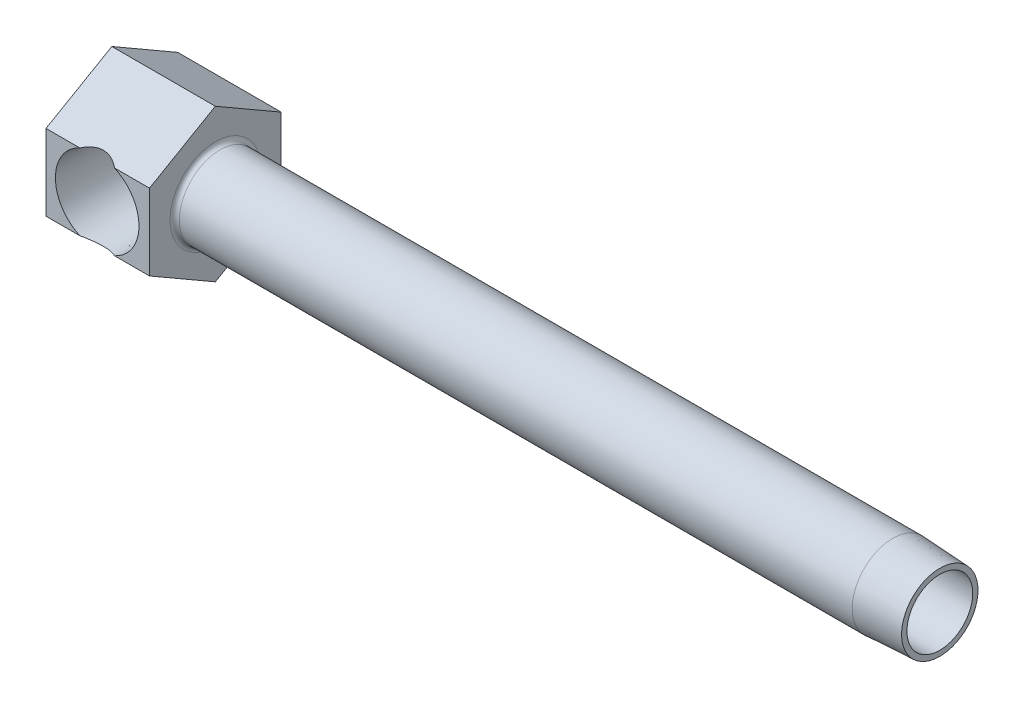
ISO-10303-21;
HEADER;
FILE_DESCRIPTION(('STEP AP214'),'2;1');
FILE_NAME('part.step','',(''),(''),'','','');
FILE_SCHEMA(('AUTOMOTIVE_DESIGN { 1 0 10303 214 1 1 1 1 }'));
ENDSEC;
DATA;
#1=APPLICATION_CONTEXT('core data for automotive mechanical design processes');
#2=APPLICATION_PROTOCOL_DEFINITION('international standard','automotive_design',2000,#1);
#3=PRODUCT_CONTEXT('',#1,'mechanical');
#4=PRODUCT('Part','Part','',(#3));
#5=PRODUCT_RELATED_PRODUCT_CATEGORY('part','',(#4));
#6=PRODUCT_DEFINITION_FORMATION('','',#4);
#7=PRODUCT_DEFINITION_CONTEXT('part definition',#1,'design');
#8=PRODUCT_DEFINITION('design','',#6,#7);
#9=PRODUCT_DEFINITION_SHAPE('','',#8);
#10=(LENGTH_UNIT() NAMED_UNIT(*) SI_UNIT(.MILLI.,.METRE.));
#11=(NAMED_UNIT(*) PLANE_ANGLE_UNIT() SI_UNIT($,.RADIAN.));
#12=(NAMED_UNIT(*) SI_UNIT($,.STERADIAN.) SOLID_ANGLE_UNIT());
#13=UNCERTAINTY_MEASURE_WITH_UNIT(LENGTH_MEASURE(1.E-05),#10,'distance_accuracy_value','');
#14=(GEOMETRIC_REPRESENTATION_CONTEXT(3) GLOBAL_UNCERTAINTY_ASSIGNED_CONTEXT((#13)) GLOBAL_UNIT_ASSIGNED_CONTEXT((#10,
#11,#12)) REPRESENTATION_CONTEXT('',''));
#15=CARTESIAN_POINT('',(0.,0.,0.));
#16=DIRECTION('',(0.,0.,1.));
#17=DIRECTION('',(1.,0.,0.));
#18=AXIS2_PLACEMENT_3D('',#15,#16,#17);
#19=CARTESIAN_POINT('',(63.5,0.,11.1125));
#20=DIRECTION('',(-1.,0.,0.));
#21=DIRECTION('',(0.,0.,1.));
#22=AXIS2_PLACEMENT_3D('',#19,#20,#21);
#23=CYLINDRICAL_SURFACE('',#22,6.858);
#24=CARTESIAN_POINT('',(18.2499,0.,11.1125));
#25=DIRECTION('',(-1.,0.,0.));
#26=DIRECTION('',(0.,-1.,0.));
#27=AXIS2_PLACEMENT_3D('',#24,#25,#26);
#28=CIRCLE('',#27,6.858);
#29=CARTESIAN_POINT('',(18.2499,-6.858,11.1125));
#30=VERTEX_POINT('',#29);
#31=EDGE_CURVE('E174',#30,#30,#28,.F.);
#32=ORIENTED_EDGE('',*,*,#31,.T.);
#33=EDGE_LOOP('',(#32));
#34=FACE_BOUND('',#33,.T.);
#35=CARTESIAN_POINT('',(131.7752,0.,11.1125));
#36=DIRECTION('',(1.,0.,0.));
#37=DIRECTION('',(0.,0.,-1.));
#38=AXIS2_PLACEMENT_3D('',#35,#36,#37);
#39=CIRCLE('',#38,6.858);
#40=CARTESIAN_POINT('',(131.7752,0.,4.2545));
#41=VERTEX_POINT('',#40);
#42=EDGE_CURVE('E218',#41,#41,#39,.T.);
#43=ORIENTED_EDGE('',*,*,#42,.F.);
#44=EDGE_LOOP('',(#43));
#45=FACE_BOUND('',#44,.T.);
#46=ADVANCED_FACE('F15',(#34,#45),#23,.T.);
#47=CARTESIAN_POINT('',(17.4625,6.4158048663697,22.225));
#48=DIRECTION('',(0.,0.,-1.));
#49=DIRECTION('',(0.,1.,0.));
#50=AXIS2_PLACEMENT_3D('',#47,#48,#49);
#51=PLANE('',#50);
#52=CARTESIAN_POINT('',(8.636,0.,22.225));
#53=DIRECTION('',(0.,0.,1.));
#54=DIRECTION('',(1.,0.,0.));
#55=AXIS2_PLACEMENT_3D('',#52,#53,#54);
#56=CIRCLE('',#55,7.05231);
#57=CARTESIAN_POINT('',(5.70811266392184,6.4158048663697,22.225));
#58=VERTEX_POINT('',#57);
#59=CARTESIAN_POINT('',(5.70811266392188,-6.41580486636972,22.225));
#60=VERTEX_POINT('',#59);
#61=EDGE_CURVE('E229',#58,#60,#56,.T.);
#62=ORIENTED_EDGE('',*,*,#61,.F.);
#63=DIRECTION('',(-1.,0.,0.));
#64=VECTOR('',#63,1.);
#65=CARTESIAN_POINT('',(17.4625,6.4158048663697,22.225));
#66=LINE('',#65,#64);
#67=CARTESIAN_POINT('',(0.,6.4158048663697,22.225));
#68=VERTEX_POINT('',#67);
#69=EDGE_CURVE('E158',#58,#68,#66,.T.);
#70=ORIENTED_EDGE('',*,*,#69,.T.);
#71=DIRECTION('',(0.,-1.,0.));
#72=VECTOR('',#71,1.);
#73=CARTESIAN_POINT('',(0.,6.4158048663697,22.225));
#74=LINE('',#73,#72);
#75=CARTESIAN_POINT('',(0.,-6.41580486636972,22.225));
#76=VERTEX_POINT('',#75);
#77=EDGE_CURVE('E128',#68,#76,#74,.T.);
#78=ORIENTED_EDGE('',*,*,#77,.T.);
#79=DIRECTION('',(-1.,0.,0.));
#80=VECTOR('',#79,1.);
#81=CARTESIAN_POINT('',(17.4625,-6.41580486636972,22.225));
#82=LINE('',#81,#80);
#83=EDGE_CURVE('E154',#60,#76,#82,.T.);
#84=ORIENTED_EDGE('',*,*,#83,.F.);
#85=EDGE_LOOP('',(#62,#70,#78,#84));
#86=FACE_BOUND('',#85,.T.);
#87=ADVANCED_FACE('F205',(#86),#51,.F.);
#88=CARTESIAN_POINT('',(11.5638873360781,-6.41580486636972,22.225));
#89=VERTEX_POINT('',#88);
#90=CARTESIAN_POINT('',(11.5638873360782,6.4158048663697,22.225));
#91=VERTEX_POINT('',#90);
#92=EDGE_CURVE('E228',#89,#91,#56,.T.);
#93=ORIENTED_EDGE('',*,*,#92,.F.);
#94=CARTESIAN_POINT('',(17.4625,-6.41580486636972,22.225));
#95=VERTEX_POINT('',#94);
#96=EDGE_CURVE('E155',#95,#89,#82,.T.);
#97=ORIENTED_EDGE('',*,*,#96,.F.);
#98=DIRECTION('',(0.,-1.,0.));
#99=VECTOR('',#98,1.);
#100=CARTESIAN_POINT('',(17.4625,6.4158048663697,22.225));
#101=LINE('',#100,#99);
#102=CARTESIAN_POINT('',(17.4625,6.4158048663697,22.225));
#103=VERTEX_POINT('',#102);
#104=EDGE_CURVE('E145',#103,#95,#101,.T.);
#105=ORIENTED_EDGE('',*,*,#104,.F.);
#106=EDGE_CURVE('E159',#103,#91,#66,.T.);
#107=ORIENTED_EDGE('',*,*,#106,.T.);
#108=EDGE_LOOP('',(#93,#97,#105,#107));
#109=FACE_BOUND('',#108,.T.);
#110=ADVANCED_FACE('F211',(#109),#51,.F.);
#111=CARTESIAN_POINT('',(17.4625,12.8316097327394,11.1125));
#112=DIRECTION('',(0.,-0.866025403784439,-0.5));
#113=DIRECTION('',(0.,0.5,-0.866025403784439));
#114=AXIS2_PLACEMENT_3D('',#111,#112,#113);
#115=PLANE('',#114);
#116=ORIENTED_EDGE('',*,*,#69,.F.);
#117=CARTESIAN_POINT('',(8.636,-0.384020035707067,34.002642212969));
#118=DIRECTION('',(0.,-0.866025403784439,-0.5));
#119=DIRECTION('',(0.,-0.5,0.866025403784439));
#120=AXIS2_PLACEMENT_3D('',#117,#118,#119);
#121=ELLIPSE('',#120,14.8098967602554,7.39498405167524);
#122=EDGE_CURVE('E109',#58,#91,#121,.T.);
#123=ORIENTED_EDGE('',*,*,#122,.T.);
#124=ORIENTED_EDGE('',*,*,#106,.F.);
#125=DIRECTION('',(0.,-0.5,0.866025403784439));
#126=VECTOR('',#125,1.);
#127=CARTESIAN_POINT('',(17.4625,12.8316097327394,11.1125));
#128=LINE('',#127,#126);
#129=CARTESIAN_POINT('',(17.4625,12.8316097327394,11.1125));
#130=VERTEX_POINT('',#129);
#131=EDGE_CURVE('E143',#130,#103,#128,.T.);
#132=ORIENTED_EDGE('',*,*,#131,.F.);
#133=DIRECTION('',(-1.,0.,0.));
#134=VECTOR('',#133,1.);
#135=CARTESIAN_POINT('',(17.4625,12.8316097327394,11.1125));
#136=LINE('',#135,#134);
#137=CARTESIAN_POINT('',(0.,12.8316097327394,11.1125));
#138=VERTEX_POINT('',#137);
#139=EDGE_CURVE('E162',#130,#138,#136,.T.);
#140=ORIENTED_EDGE('',*,*,#139,.T.);
#141=DIRECTION('',(0.,-0.5,0.866025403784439));
#142=VECTOR('',#141,1.);
#143=CARTESIAN_POINT('',(0.,12.8316097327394,11.1125));
#144=LINE('',#143,#142);
#145=EDGE_CURVE('E124',#138,#68,#144,.T.);
#146=ORIENTED_EDGE('',*,*,#145,.T.);
#147=EDGE_LOOP('',(#116,#123,#124,#132,#140,#146));
#148=FACE_BOUND('',#147,.T.);
#149=ADVANCED_FACE('F257',(#148),#115,.F.);
#150=CARTESIAN_POINT('',(17.4625,-6.41580486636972,22.225));
#151=DIRECTION('',(0.,0.866025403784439,-0.5));
#152=DIRECTION('',(0.,0.5,0.866025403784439));
#153=AXIS2_PLACEMENT_3D('',#150,#151,#152);
#154=PLANE('',#153);
#155=ORIENTED_EDGE('',*,*,#96,.T.);
#156=CARTESIAN_POINT('',(8.636,0.384020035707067,34.0026422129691));
#157=DIRECTION('',(0.,0.866025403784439,-0.5));
#158=DIRECTION('',(0.,0.5,0.866025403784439));
#159=AXIS2_PLACEMENT_3D('',#156,#157,#158);
#160=ELLIPSE('',#159,14.8098967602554,7.39498405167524);
#161=EDGE_CURVE('E34',#89,#60,#160,.T.);
#162=ORIENTED_EDGE('',*,*,#161,.T.);
#163=ORIENTED_EDGE('',*,*,#83,.T.);
#164=DIRECTION('',(0.,-0.5,-0.866025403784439));
#165=VECTOR('',#164,1.);
#166=CARTESIAN_POINT('',(0.,-6.41580486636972,22.225));
#167=LINE('',#166,#165);
#168=CARTESIAN_POINT('',(0.,-12.8316097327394,11.1125));
#169=VERTEX_POINT('',#168);
#170=EDGE_CURVE('E132',#76,#169,#167,.T.);
#171=ORIENTED_EDGE('',*,*,#170,.T.);
#172=DIRECTION('',(-1.,0.,0.));
#173=VECTOR('',#172,1.);
#174=CARTESIAN_POINT('',(17.4625,-12.8316097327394,11.1125));
#175=LINE('',#174,#173);
#176=CARTESIAN_POINT('',(17.4625,-12.8316097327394,11.1125));
#177=VERTEX_POINT('',#176);
#178=EDGE_CURVE('E149',#177,#169,#175,.T.);
#179=ORIENTED_EDGE('',*,*,#178,.F.);
#180=DIRECTION('',(0.,-0.5,-0.866025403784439));
#181=VECTOR('',#180,1.);
#182=CARTESIAN_POINT('',(17.4625,-6.41580486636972,22.225));
#183=LINE('',#182,#181);
#184=EDGE_CURVE('E147',#95,#177,#183,.T.);
#185=ORIENTED_EDGE('',*,*,#184,.F.);
#186=EDGE_LOOP('',(#155,#162,#163,#171,#179,#185));
#187=FACE_BOUND('',#186,.T.);
#188=ADVANCED_FACE('F235',(#187),#154,.F.);
#189=CARTESIAN_POINT('',(17.4625,-12.8316097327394,11.1125));
#190=DIRECTION('',(0.,0.866025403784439,0.5));
#191=DIRECTION('',(0.,-0.5,0.866025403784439));
#192=AXIS2_PLACEMENT_3D('',#189,#190,#191);
#193=PLANE('',#192);
#194=DIRECTION('',(0.,0.5,-0.866025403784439));
#195=VECTOR('',#194,1.);
#196=CARTESIAN_POINT('',(0.,-12.8316097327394,11.1125));
#197=LINE('',#196,#195);
#198=CARTESIAN_POINT('',(0.,-6.41580486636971,0.));
#199=VERTEX_POINT('',#198);
#200=EDGE_CURVE('E117',#169,#199,#197,.T.);
#201=ORIENTED_EDGE('',*,*,#200,.T.);
#202=DIRECTION('',(-1.,0.,0.));
#203=VECTOR('',#202,1.);
#204=CARTESIAN_POINT('',(17.4625,-6.41580486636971,0.));
#205=LINE('',#204,#203);
#206=CARTESIAN_POINT('',(17.4625,-6.41580486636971,0.));
#207=VERTEX_POINT('',#206);
#208=EDGE_CURVE('E168',#207,#199,#205,.T.);
#209=ORIENTED_EDGE('',*,*,#208,.F.);
#210=DIRECTION('',(0.,0.5,-0.866025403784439));
#211=VECTOR('',#210,1.);
#212=CARTESIAN_POINT('',(17.4625,-12.8316097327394,11.1125));
#213=LINE('',#212,#211);
#214=EDGE_CURVE('E135',#177,#207,#213,.T.);
#215=ORIENTED_EDGE('',*,*,#214,.F.);
#216=ORIENTED_EDGE('',*,*,#178,.T.);
#217=EDGE_LOOP('',(#201,#209,#215,#216));
#218=FACE_BOUND('',#217,.T.);
#219=ADVANCED_FACE('F247',(#218),#193,.F.);
#220=CARTESIAN_POINT('',(17.4625,-6.41580486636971,0.));
#221=DIRECTION('',(0.,0.,1.));
#222=DIRECTION('',(1.,0.,0.));
#223=AXIS2_PLACEMENT_3D('',#220,#221,#222);
#224=PLANE('',#223);
#225=DIRECTION('',(0.,1.,0.));
#226=VECTOR('',#225,1.);
#227=CARTESIAN_POINT('',(0.,-6.41580486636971,0.));
#228=LINE('',#227,#226);
#229=CARTESIAN_POINT('',(0.,6.41580486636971,0.));
#230=VERTEX_POINT('',#229);
#231=EDGE_CURVE('E118',#199,#230,#228,.T.);
#232=ORIENTED_EDGE('',*,*,#231,.T.);
#233=DIRECTION('',(-1.,0.,0.));
#234=VECTOR('',#233,1.);
#235=CARTESIAN_POINT('',(17.4625,6.41580486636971,0.));
#236=LINE('',#235,#234);
#237=CARTESIAN_POINT('',(17.4625,6.41580486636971,0.));
#238=VERTEX_POINT('',#237);
#239=EDGE_CURVE('E165',#238,#230,#236,.T.);
#240=ORIENTED_EDGE('',*,*,#239,.F.);
#241=DIRECTION('',(0.,1.,0.));
#242=VECTOR('',#241,1.);
#243=CARTESIAN_POINT('',(17.4625,-6.41580486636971,0.));
#244=LINE('',#243,#242);
#245=EDGE_CURVE('E139',#207,#238,#244,.T.);
#246=ORIENTED_EDGE('',*,*,#245,.F.);
#247=ORIENTED_EDGE('',*,*,#208,.T.);
#248=EDGE_LOOP('',(#232,#240,#246,#247));
#249=FACE_BOUND('',#248,.T.);
#250=ADVANCED_FACE('F264',(#249),#224,.F.);
#251=CARTESIAN_POINT('',(17.4625,6.4158048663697,0.));
#252=DIRECTION('',(0.,-0.866025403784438,0.5));
#253=DIRECTION('',(0.,-0.5,-0.866025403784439));
#254=AXIS2_PLACEMENT_3D('',#251,#252,#253);
#255=PLANE('',#254);
#256=DIRECTION('',(0.,0.5,0.866025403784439));
#257=VECTOR('',#256,1.);
#258=CARTESIAN_POINT('',(0.,6.4158048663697,0.));
#259=LINE('',#258,#257);
#260=EDGE_CURVE('E121',#230,#138,#259,.T.);
#261=ORIENTED_EDGE('',*,*,#260,.T.);
#262=ORIENTED_EDGE('',*,*,#139,.F.);
#263=DIRECTION('',(0.,0.5,0.866025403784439));
#264=VECTOR('',#263,1.);
#265=CARTESIAN_POINT('',(17.4625,6.4158048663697,0.));
#266=LINE('',#265,#264);
#267=EDGE_CURVE('E141',#238,#130,#266,.T.);
#268=ORIENTED_EDGE('',*,*,#267,.F.);
#269=ORIENTED_EDGE('',*,*,#239,.T.);
#270=EDGE_LOOP('',(#261,#262,#268,#269));
#271=FACE_BOUND('',#270,.T.);
#272=ADVANCED_FACE('F261',(#271),#255,.F.);
#273=CARTESIAN_POINT('',(17.4625,-19.2474145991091,22.225));
#274=DIRECTION('',(-1.,0.,0.));
#275=DIRECTION('',(0.,-1.,0.));
#276=AXIS2_PLACEMENT_3D('',#273,#274,#275);
#277=PLANE('',#276);
#278=CARTESIAN_POINT('',(17.4625,0.,11.1125));
#279=DIRECTION('',(-1.,0.,0.));
#280=DIRECTION('',(0.,-1.,0.));
#281=AXIS2_PLACEMENT_3D('',#278,#279,#280);
#282=CIRCLE('',#281,7.6454);
#283=CARTESIAN_POINT('',(17.4625,-7.6454,11.1125));
#284=VERTEX_POINT('',#283);
#285=EDGE_CURVE('E171',#284,#284,#282,.T.);
#286=ORIENTED_EDGE('',*,*,#285,.T.);
#287=EDGE_LOOP('',(#286));
#288=FACE_BOUND('',#287,.T.);
#289=ORIENTED_EDGE('',*,*,#214,.T.);
#290=ORIENTED_EDGE('',*,*,#245,.T.);
#291=ORIENTED_EDGE('',*,*,#267,.T.);
#292=ORIENTED_EDGE('',*,*,#131,.T.);
#293=ORIENTED_EDGE('',*,*,#104,.T.);
#294=ORIENTED_EDGE('',*,*,#184,.T.);
#295=EDGE_LOOP('',(#289,#290,#291,#292,#293,#294));
#296=FACE_BOUND('',#295,.T.);
#297=ADVANCED_FACE('F250',(#288,#296),#277,.F.);
#298=CARTESIAN_POINT('',(0.,-19.2474145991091,22.225));
#299=DIRECTION('',(-1.,0.,0.));
#300=DIRECTION('',(0.,-1.,0.));
#301=AXIS2_PLACEMENT_3D('',#298,#299,#300);
#302=PLANE('',#301);
#303=ORIENTED_EDGE('',*,*,#200,.F.);
#304=ORIENTED_EDGE('',*,*,#170,.F.);
#305=ORIENTED_EDGE('',*,*,#77,.F.);
#306=ORIENTED_EDGE('',*,*,#145,.F.);
#307=ORIENTED_EDGE('',*,*,#260,.F.);
#308=ORIENTED_EDGE('',*,*,#231,.F.);
#309=EDGE_LOOP('',(#303,#304,#305,#306,#307,#308));
#310=FACE_BOUND('',#309,.T.);
#311=ADVANCED_FACE('F243',(#310),#302,.T.);
#312=CARTESIAN_POINT('',(18.2499,0.,11.1125));
#313=DIRECTION('',(-1.,0.,0.));
#314=DIRECTION('',(0.,-1.,0.));
#315=AXIS2_PLACEMENT_3D('',#312,#313,#314);
#316=TOROIDAL_SURFACE('',#315,7.6454,0.7874);
#317=ORIENTED_EDGE('',*,*,#31,.F.);
#318=EDGE_LOOP('',(#317));
#319=FACE_BOUND('',#318,.T.);
#320=ORIENTED_EDGE('',*,*,#285,.F.);
#321=EDGE_LOOP('',(#320));
#322=FACE_BOUND('',#321,.T.);
#323=ADVANCED_FACE('F282',(#319,#322),#316,.F.);
#324=CARTESIAN_POINT('',(63.5,0.,11.1125));
#325=DIRECTION('',(1.,0.,0.));
#326=DIRECTION('',(0.,0.,-1.));
#327=AXIS2_PLACEMENT_3D('',#324,#325,#326);
#328=CYLINDRICAL_SURFACE('',#327,5.5499);
#329=DIRECTION('',(1.,0.,0.));
#330=VECTOR('',#329,1.);
#331=CARTESIAN_POINT('',(63.5,1.29165930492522,5.715));
#332=LINE('',#331,#330);
#333=CARTESIAN_POINT('',(15.0655177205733,1.29165930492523,5.715));
#334=VERTEX_POINT('',#333);
#335=CARTESIAN_POINT('',(14.0465577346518,1.29165930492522,5.715));
#336=VERTEX_POINT('',#335);
#337=EDGE_CURVE('E27',#334,#336,#332,.F.);
#338=ORIENTED_EDGE('',*,*,#337,.T.);
#339=CARTESIAN_POINT('',(14.0465577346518,1.29165930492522,5.715));
#340=CARTESIAN_POINT('',(14.0725617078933,1.1828202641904,5.68893317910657));
#341=CARTESIAN_POINT('',(14.0954190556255,1.0724477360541,5.66602138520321));
#342=CARTESIAN_POINT('',(14.1345363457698,0.849345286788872,5.62681178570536));
#343=CARTESIAN_POINT('',(14.1507939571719,0.736614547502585,5.61051631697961));
#344=CARTESIAN_POINT('',(14.1760383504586,0.512691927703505,5.58521342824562));
#345=CARTESIAN_POINT('',(14.1852120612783,0.401542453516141,5.57601863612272));
#346=CARTESIAN_POINT('',(14.1968530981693,0.17856718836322,5.56435088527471));
#347=CARTESIAN_POINT('',(14.1993222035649,0.0667415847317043,5.56187614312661));
#348=CARTESIAN_POINT('',(14.1975723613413,-0.14949882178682,5.56362999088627));
#349=CARTESIAN_POINT('',(14.193779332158,-0.253921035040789,5.56743168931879));
#350=CARTESIAN_POINT('',(14.1803598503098,-0.462026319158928,5.58088200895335));
#351=CARTESIAN_POINT('',(14.1707325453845,-0.565709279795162,5.59053148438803));
#352=CARTESIAN_POINT('',(14.1454600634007,-0.774399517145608,5.61586264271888));
#353=CARTESIAN_POINT('',(14.12966315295,-0.87936981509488,5.63169642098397));
#354=CARTESIAN_POINT('',(14.092340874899,-1.08722287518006,5.6691068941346));
#355=CARTESIAN_POINT('',(14.0708169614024,-1.1901061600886,5.69068213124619));
#356=CARTESIAN_POINT('',(14.0465577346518,-1.29165930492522,5.715));
#357=B_SPLINE_CURVE_WITH_KNOTS('',3,(#339,#340,#341,#342,#343,#344,#345,#346,#347,#348,#349,
#350,#351,#352,#353,#354,#355,#356),.UNSPECIFIED.,.F.,.F.,(4,2,2,2,2,2,2,2,4),(0.,
0.344637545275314,0.689396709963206,1.02471413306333,1.35994255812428,1.67329546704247,
1.98669416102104,2.30834220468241,2.62990865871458),.UNSPECIFIED.);
#358=CARTESIAN_POINT('',(14.0465577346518,-1.29165930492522,5.715));
#359=VERTEX_POINT('',#358);
#360=EDGE_CURVE('E10',#336,#359,#357,.T.);
#361=ORIENTED_EDGE('',*,*,#360,.T.);
#362=DIRECTION('',(1.,0.,0.));
#363=VECTOR('',#362,1.);
#364=CARTESIAN_POINT('',(63.5,-1.29165930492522,5.715));
#365=LINE('',#364,#363);
#366=CARTESIAN_POINT('',(15.0655177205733,-1.29165930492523,5.715));
#367=VERTEX_POINT('',#366);
#368=EDGE_CURVE('E184',#359,#367,#365,.T.);
#369=ORIENTED_EDGE('',*,*,#368,.T.);
#370=CARTESIAN_POINT('',(15.0656795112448,-1.29082327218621,5.71480000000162));
#371=CARTESIAN_POINT('',(15.0372536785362,-1.43791824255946,5.7499521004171));
#372=CARTESIAN_POINT('',(15.0041876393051,-1.58262926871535,5.79093746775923));
#373=CARTESIAN_POINT('',(14.9298152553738,-1.86616189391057,5.88364074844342));
#374=CARTESIAN_POINT('',(14.8885204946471,-2.00499144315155,5.93534357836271));
#375=CARTESIAN_POINT('',(14.7990709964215,-2.27477346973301,6.0481148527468));
#376=CARTESIAN_POINT('',(14.7509848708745,-2.40578805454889,6.10909004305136));
#377=CARTESIAN_POINT('',(14.6486806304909,-2.66083130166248,6.2399326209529));
#378=CARTESIAN_POINT('',(14.5944604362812,-2.78485757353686,6.30980302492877));
#379=CARTESIAN_POINT('',(14.4812536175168,-3.02482355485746,6.4572285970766));
#380=CARTESIAN_POINT('',(14.4222960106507,-3.1408054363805,6.53473755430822));
#381=CARTESIAN_POINT('',(14.3003856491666,-3.365215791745,6.6970845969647));
#382=CARTESIAN_POINT('',(14.2374332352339,-3.47364490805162,6.78192205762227));
#383=CARTESIAN_POINT('',(14.0435453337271,-3.78827180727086,7.04729631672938));
#384=CARTESIAN_POINT('',(13.9079456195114,-3.9830565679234,7.23822682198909));
#385=CARTESIAN_POINT('',(13.689310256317,-4.26816238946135,7.56146618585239));
#386=CARTESIAN_POINT('',(13.6074310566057,-4.3686517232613,7.68585924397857));
#387=CARTESIAN_POINT('',(13.4442899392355,-4.55879004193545,7.94320688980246));
#388=CARTESIAN_POINT('',(13.3630282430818,-4.6484352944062,8.07616440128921));
#389=CARTESIAN_POINT('',(13.2036424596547,-4.81645966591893,8.35044586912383));
#390=CARTESIAN_POINT('',(13.1255135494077,-4.89485662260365,8.49175606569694));
#391=CARTESIAN_POINT('',(12.9752684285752,-5.04004510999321,8.78316437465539));
#392=CARTESIAN_POINT('',(12.9031480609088,-5.10684469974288,8.93325628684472));
#393=CARTESIAN_POINT('',(12.757824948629,-5.23785122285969,9.26762207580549));
#394=CARTESIAN_POINT('',(12.686320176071,-5.29990617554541,9.45350692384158));
#395=CARTESIAN_POINT('',(12.5645322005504,-5.40502712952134,9.83721903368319));
#396=CARTESIAN_POINT('',(12.5142004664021,-5.44813656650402,10.035017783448));
#397=CARTESIAN_POINT('',(12.4606756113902,-5.49679755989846,10.3395644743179));
#398=CARTESIAN_POINT('',(12.4464754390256,-5.51038902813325,10.443158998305));
#399=CARTESIAN_POINT('',(12.4264834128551,-5.5317354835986,10.6517762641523));
#400=CARTESIAN_POINT('',(12.4206908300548,-5.53949097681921,10.7567988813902));
#401=CARTESIAN_POINT('',(12.4179376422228,-5.54899639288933,10.9671942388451));
#402=CARTESIAN_POINT('',(12.4209736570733,-5.55074861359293,11.0725668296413));
#403=CARTESIAN_POINT('',(12.4357182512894,-5.54828805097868,11.2826067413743));
#404=CARTESIAN_POINT('',(12.4474268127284,-5.54407527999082,11.3872740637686));
#405=CARTESIAN_POINT('',(12.4900727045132,-5.52483789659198,11.6684350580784));
#406=CARTESIAN_POINT('',(12.5287513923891,-5.5042766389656,11.8434168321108));
#407=CARTESIAN_POINT('',(12.6245766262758,-5.44793106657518,12.1856637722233));
#408=CARTESIAN_POINT('',(12.6817493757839,-5.41212512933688,12.3529176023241));
#409=CARTESIAN_POINT('',(12.8020710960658,-5.33165221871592,12.6608364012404));
#410=CARTESIAN_POINT('',(12.8638814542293,-5.28838367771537,12.8024081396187));
#411=CARTESIAN_POINT('',(12.9946271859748,-5.19196308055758,13.0788046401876));
#412=CARTESIAN_POINT('',(13.0635675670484,-5.13880405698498,13.2136245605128));
#413=CARTESIAN_POINT('',(13.2061680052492,-5.0230773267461,13.476991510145));
#414=CARTESIAN_POINT('',(13.2798387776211,-4.96048779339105,13.6055230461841));
#415=CARTESIAN_POINT('',(13.4297455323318,-4.82635797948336,13.8561944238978));
#416=CARTESIAN_POINT('',(13.505980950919,-4.75481965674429,13.9783356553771));
#417=CARTESIAN_POINT('',(13.664111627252,-4.59832635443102,14.2236446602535));
#418=CARTESIAN_POINT('',(13.7460684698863,-4.51281916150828,14.3464205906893));
#419=CARTESIAN_POINT('',(13.9094765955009,-4.33199713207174,14.5849036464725));
#420=CARTESIAN_POINT('',(13.9909278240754,-4.23668125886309,14.7006100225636));
#421=CARTESIAN_POINT('',(14.1517819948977,-4.03638256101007,14.9245234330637));
#422=CARTESIAN_POINT('',(14.231187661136,-3.93141354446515,15.0327408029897));
#423=CARTESIAN_POINT('',(14.3867175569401,-3.71172769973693,15.2413555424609));
#424=CARTESIAN_POINT('',(14.4628409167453,-3.59700831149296,15.3417508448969));
#425=CARTESIAN_POINT('',(14.668135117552,-3.26437402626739,15.6091426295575));
#426=CARTESIAN_POINT('',(14.7924014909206,-3.03572507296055,15.7670513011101));
#427=CARTESIAN_POINT('',(14.961823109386,-2.67104021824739,15.9794040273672));
#428=CARTESIAN_POINT('',(15.0154673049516,-2.54586009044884,16.0461031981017));
#429=CARTESIAN_POINT('',(15.1161712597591,-2.28856209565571,16.1705894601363));
#430=CARTESIAN_POINT('',(15.1632322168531,-2.15644549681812,16.2283781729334));
#431=CARTESIAN_POINT('',(15.2428146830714,-1.9076542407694,16.3256678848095));
#432=CARTESIAN_POINT('',(15.2764575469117,-1.79190088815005,16.3666154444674));
#433=CARTESIAN_POINT('',(15.3378292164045,-1.55651069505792,16.4410921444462));
#434=CARTESIAN_POINT('',(15.3655591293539,-1.43687458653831,16.4746226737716));
#435=CARTESIAN_POINT('',(15.4145953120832,-1.19439983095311,16.5337884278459));
#436=CARTESIAN_POINT('',(15.4359031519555,-1.0715619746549,16.5594255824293));
#437=CARTESIAN_POINT('',(15.4716760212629,-0.823504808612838,16.6024058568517));
#438=CARTESIAN_POINT('',(15.4861437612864,-0.698286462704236,16.6197522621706));
#439=CARTESIAN_POINT('',(15.5079865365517,-0.445852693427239,16.645922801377));
#440=CARTESIAN_POINT('',(15.5153340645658,-0.318631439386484,16.6547138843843));
#441=CARTESIAN_POINT('',(15.522677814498,-0.063671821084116,16.6635004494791));
#442=CARTESIAN_POINT('',(15.5226740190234,0.0640665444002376,16.6634959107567));
#443=CARTESIAN_POINT('',(15.5153149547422,0.319031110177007,16.6546910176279));
#444=CARTESIAN_POINT('',(15.5079593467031,0.446257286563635,16.64589025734));
#445=CARTESIAN_POINT('',(15.4860583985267,0.699182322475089,16.6196499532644));
#446=CARTESIAN_POINT('',(15.4715132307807,0.824881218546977,16.6022106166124));
#447=CARTESIAN_POINT('',(15.4365532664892,1.06681669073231,16.5602063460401));
#448=CARTESIAN_POINT('',(15.4165150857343,1.18318753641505,16.5360979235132));
#449=CARTESIAN_POINT('',(15.370668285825,1.41308832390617,16.4807930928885));
#450=CARTESIAN_POINT('',(15.3448577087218,1.52661728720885,16.4495942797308));
#451=CARTESIAN_POINT('',(15.2593968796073,1.8619852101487,16.3459550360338));
#452=CARTESIAN_POINT('',(15.1916934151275,2.07876635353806,16.2634431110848));
#453=CARTESIAN_POINT('',(15.0313088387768,2.51543897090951,16.0659794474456));
#454=CARTESIAN_POINT('',(14.9368359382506,2.73357267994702,15.9486491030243));
#455=CARTESIAN_POINT('',(14.7321201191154,3.14711164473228,15.6903358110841));
#456=CARTESIAN_POINT('',(14.6218705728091,3.34250728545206,15.549342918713));
#457=CARTESIAN_POINT('',(14.3660176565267,3.74896640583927,15.2149275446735));
#458=CARTESIAN_POINT('',(14.217881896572,3.95452519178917,15.0167316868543));
#459=CARTESIAN_POINT('',(13.9905991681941,4.23685264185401,14.7000501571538));
#460=CARTESIAN_POINT('',(13.9138995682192,4.32671599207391,14.5911203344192));
#461=CARTESIAN_POINT('',(13.7600052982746,4.49774000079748,14.366972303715));
#462=CARTESIAN_POINT('',(13.682810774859,4.57890311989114,14.2517558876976));
#463=CARTESIAN_POINT('',(13.5283146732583,4.73340315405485,14.0136509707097));
#464=CARTESIAN_POINT('',(13.4510233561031,4.80663208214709,13.8906858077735));
#465=CARTESIAN_POINT('',(13.2989020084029,4.94395744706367,13.6382338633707));
#466=CARTESIAN_POINT('',(13.2240725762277,5.00805167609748,13.5087455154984));
#467=CARTESIAN_POINT('',(13.0790371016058,5.12664196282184,13.2432341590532));
#468=CARTESIAN_POINT('',(13.0088235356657,5.18115389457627,13.107222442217));
#469=CARTESIAN_POINT('',(12.8755190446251,5.28008101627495,12.8283198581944));
#470=CARTESIAN_POINT('',(12.8124234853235,5.3245027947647,12.6854335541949));
#471=CARTESIAN_POINT('',(12.6833891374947,5.4112685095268,12.3591277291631));
#472=CARTESIAN_POINT('',(12.6200540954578,5.45085356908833,12.1738679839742));
#473=CARTESIAN_POINT('',(12.5423523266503,5.49611259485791,11.8892630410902));
#474=CARTESIAN_POINT('',(12.5193453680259,5.50884182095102,11.7933456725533));
#475=CARTESIAN_POINT('',(12.4799604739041,5.52933440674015,11.5996550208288));
#476=CARTESIAN_POINT('',(12.4635791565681,5.53710030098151,11.5018827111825));
#477=CARTESIAN_POINT('',(12.4380468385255,5.54748556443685,11.3040796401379));
#478=CARTESIAN_POINT('',(12.4289726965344,5.55005064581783,11.2040359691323));
#479=CARTESIAN_POINT('',(12.418786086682,5.54973569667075,11.0035516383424));
#480=CARTESIAN_POINT('',(12.4176731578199,5.54685598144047,10.9031110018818));
#481=CARTESIAN_POINT('',(12.4234254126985,5.53566138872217,10.7027211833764));
#482=CARTESIAN_POINT('',(12.4302942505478,5.52734402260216,10.6027722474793));
#483=CARTESIAN_POINT('',(12.4515981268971,5.5054275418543,10.4042328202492));
#484=CARTESIAN_POINT('',(12.4660373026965,5.4918255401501,10.3056431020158));
#485=CARTESIAN_POINT('',(12.5044721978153,5.45712893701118,10.0955734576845));
#486=CARTESIAN_POINT('',(12.5295946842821,5.43520467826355,9.98443807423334));
#487=CARTESIAN_POINT('',(12.5874763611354,5.38514310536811,9.76556012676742));
#488=CARTESIAN_POINT('',(12.6202414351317,5.35700100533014,9.65782024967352));
#489=CARTESIAN_POINT('',(12.6919869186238,5.29489520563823,9.44585515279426));
#490=CARTESIAN_POINT('',(12.7309829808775,5.2609168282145,9.34163960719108));
#491=CARTESIAN_POINT('',(12.813732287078,5.18758941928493,9.13712531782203));
#492=CARTESIAN_POINT('',(12.8574843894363,5.14824167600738,9.03682564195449));
#493=CARTESIAN_POINT('',(12.9739768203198,5.04107082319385,8.78510193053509));
#494=CARTESIAN_POINT('',(13.0492646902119,4.96961386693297,8.63639571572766));
#495=CARTESIAN_POINT('',(13.2048344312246,4.81508369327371,8.34787401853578));
#496=CARTESIAN_POINT('',(13.2851189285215,4.73200433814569,8.20806329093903));
#497=CARTESIAN_POINT('',(13.4480056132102,4.55446924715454,7.93688996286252));
#498=CARTESIAN_POINT('',(13.5306114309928,4.45999483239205,7.80554179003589));
#499=CARTESIAN_POINT('',(13.6957298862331,4.25996324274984,7.55156980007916));
#500=CARTESIAN_POINT('',(13.7782425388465,4.15440825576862,7.42894426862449));
#501=CARTESIAN_POINT('',(13.9441031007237,3.92836612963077,7.18853642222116));
#502=CARTESIAN_POINT('',(14.0273794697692,3.80748613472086,7.0710730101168));
#503=CARTESIAN_POINT('',(14.1898135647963,3.55392137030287,6.84638586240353));
#504=CARTESIAN_POINT('',(14.2689704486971,3.42123420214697,6.73916421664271));
#505=CARTESIAN_POINT('',(14.420885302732,3.14485348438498,6.53641941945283));
#506=CARTESIAN_POINT('',(14.4936705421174,3.0012123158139,6.44084565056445));
#507=CARTESIAN_POINT('',(14.6312840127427,2.70291662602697,6.2621549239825));
#508=CARTESIAN_POINT('',(14.6961173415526,2.54826926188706,6.17902997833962));
#509=CARTESIAN_POINT('',(14.8204425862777,2.21665612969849,6.02094073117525));
#510=CARTESIAN_POINT('',(14.8791782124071,2.03888590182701,5.94704372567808));
#511=CARTESIAN_POINT('',(14.957111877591,1.76426185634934,5.84958505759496));
#512=CARTESIAN_POINT('',(14.9814347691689,1.67119024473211,5.81928093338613));
#513=CARTESIAN_POINT('',(15.0263924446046,1.48269404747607,5.76341790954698));
#514=CARTESIAN_POINT('',(15.047024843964,1.38726798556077,5.73786207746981));
#515=CARTESIAN_POINT('',(15.0656795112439,1.2908232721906,5.71480000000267));
#516=B_SPLINE_CURVE_WITH_KNOTS('',3,(#370,#371,#372,#373,#374,#375,#376,#377,#378,#379,#380,
#381,#382,#383,#384,#385,#386,#387,#388,#389,#390,#391,#392,#393,#394,#395,#396,#397,#398,#399,
#400,#401,#402,#403,#404,#405,#406,#407,#408,#409,#410,#411,#412,#413,#414,#415,#416,#417,#418,
#419,#420,#421,#422,#423,#424,#425,#426,#427,#428,#429,#430,#431,#432,#433,#434,#435,#436,#437,
#438,#439,#440,#441,#442,#443,#444,#445,#446,#447,#448,#449,#450,#451,#452,#453,#454,#455,#456,
#457,#458,#459,#460,#461,#462,#463,#464,#465,#466,#467,#468,#469,#470,#471,#472,#473,#474,#475,
#476,#477,#478,#479,#480,#481,#482,#483,#484,#485,#486,#487,#488,#489,#490,#491,#492,#493,#494,
#495,#496,#497,#498,#499,#500,#501,#502,#503,#504,#505,#506,#507,#508,#509,#510,#511,#512,#513,
#514,#515),.UNSPECIFIED.,.F.,.F.,(4,2,2,2,2,2,2,2,2,2,2,2,2,2,2,2,2,2,2,2,2,2,2,2,2,2,2,2,2,2,2,
2,2,2,2,2,2,2,2,2,2,2,2,2,2,2,2,2,2,2,2,2,2,2,2,2,2,2,2,2,2,2,2,2,2,2,2,2,2,2,2,2,4),(0.,
0.461329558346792,0.922014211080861,1.37833951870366,1.83481998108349,2.2886910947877,
2.74252355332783,3.65304009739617,4.19159436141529,4.73033346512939,5.26820855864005,
5.80570837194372,6.42981366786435,7.05248053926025,7.36837231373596,7.68423669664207,
7.99998016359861,8.31572297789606,8.85459341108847,9.39423071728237,9.87481564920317,
10.3557404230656,10.837795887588,11.3197460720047,11.8310943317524,12.3424966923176,
12.8531785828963,13.3639949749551,14.2729996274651,14.7275015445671,15.1819206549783,
15.5634665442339,15.9449409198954,16.3263219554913,16.707551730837,17.0902484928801,
17.472946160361,17.8556614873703,18.2383676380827,18.5995247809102,18.9608046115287,
19.682873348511,20.4753483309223,21.2681572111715,22.2295647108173,22.7113905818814,
23.1930798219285,23.6806666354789,24.1683710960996,24.6552598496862,25.1418297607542,
25.7388115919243,26.0368814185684,26.3347989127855,26.6358104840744,26.9368046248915,
27.237936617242,27.5392333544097,27.8867825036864,28.2346001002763,28.5833055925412,
28.9319275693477,29.4751694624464,30.0186993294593,30.5631325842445,31.1074585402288,
31.6708023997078,32.2342609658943,32.7951763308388,33.3557302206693,33.9579898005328,
34.2603814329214,34.5629677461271),.UNSPECIFIED.);
#517=EDGE_CURVE('E177',#367,#334,#516,.T.);
#518=ORIENTED_EDGE('',*,*,#517,.T.);
#519=EDGE_LOOP('',(#338,#361,#369,#518));
#520=FACE_BOUND('',#519,.T.);
#521=CARTESIAN_POINT('',(139.7,0.,11.1125));
#522=DIRECTION('',(1.,0.,0.));
#523=DIRECTION('',(0.,0.,-1.));
#524=AXIS2_PLACEMENT_3D('',#521,#522,#523);
#525=CIRCLE('',#524,5.5499);
#526=CARTESIAN_POINT('',(139.7,0.,5.5626));
#527=VERTEX_POINT('',#526);
#528=EDGE_CURVE('E223',#527,#527,#525,.T.);
#529=ORIENTED_EDGE('',*,*,#528,.T.);
#530=EDGE_LOOP('',(#529));
#531=FACE_BOUND('',#530,.T.);
#532=ADVANCED_FACE('F185',(#520,#531),#328,.F.);
#533=CARTESIAN_POINT('',(14.1986,0.,5.715));
#534=DIRECTION('',(0.,0.,-1.));
#535=DIRECTION('',(-1.,0.,0.));
#536=AXIS2_PLACEMENT_3D('',#533,#534,#535);
#537=PLANE('',#536);
#538=CARTESIAN_POINT('',(8.636,0.,5.715));
#539=DIRECTION('',(0.,0.,1.));
#540=DIRECTION('',(1.,0.,0.));
#541=AXIS2_PLACEMENT_3D('',#538,#539,#540);
#542=CIRCLE('',#541,6.55797849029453);
#543=EDGE_CURVE('E41',#334,#367,#542,.T.);
#544=ORIENTED_EDGE('',*,*,#543,.T.);
#545=ORIENTED_EDGE('',*,*,#368,.F.);
#546=CARTESIAN_POINT('',(8.636,0.,5.715));
#547=DIRECTION('',(0.,0.,1.));
#548=DIRECTION('',(1.,0.,0.));
#549=AXIS2_PLACEMENT_3D('',#546,#547,#548);
#550=CIRCLE('',#549,5.5626);
#551=EDGE_CURVE('E107',#336,#359,#550,.T.);
#552=ORIENTED_EDGE('',*,*,#551,.F.);
#553=ORIENTED_EDGE('',*,*,#337,.F.);
#554=EDGE_LOOP('',(#544,#545,#552,#553));
#555=FACE_BOUND('',#554,.T.);
#556=ADVANCED_FACE('F194',(#555),#537,.F.);
#557=CARTESIAN_POINT('',(8.636,0.,22.225));
#558=DIRECTION('',(0.,0.,1.));
#559=DIRECTION('',(1.,0.,0.));
#560=AXIS2_PLACEMENT_3D('',#557,#558,#559);
#561=CYLINDRICAL_SURFACE('',#560,5.5626);
#562=CARTESIAN_POINT('',(8.636,0.,4.445));
#563=DIRECTION('',(0.,0.,1.));
#564=DIRECTION('',(1.,0.,0.));
#565=AXIS2_PLACEMENT_3D('',#562,#563,#564);
#566=CIRCLE('',#565,5.5626);
#567=CARTESIAN_POINT('',(14.1986,0.,4.445));
#568=VERTEX_POINT('',#567);
#569=EDGE_CURVE('E105',#568,#568,#566,.T.);
#570=ORIENTED_EDGE('',*,*,#569,.F.);
#571=EDGE_LOOP('',(#570));
#572=FACE_BOUND('',#571,.T.);
#573=ORIENTED_EDGE('',*,*,#551,.T.);
#574=ORIENTED_EDGE('',*,*,#360,.F.);
#575=EDGE_LOOP('',(#573,#574));
#576=FACE_BOUND('',#575,.T.);
#577=ADVANCED_FACE('F192',(#572,#576),#561,.F.);
#578=CARTESIAN_POINT('',(8.636,0.,22.225));
#579=DIRECTION('',(0.,0.,1.));
#580=DIRECTION('',(1.,0.,0.));
#581=AXIS2_PLACEMENT_3D('',#578,#579,#580);
#582=CONICAL_SURFACE('',#581,7.05231,0.0299323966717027);
#583=ORIENTED_EDGE('',*,*,#543,.F.);
#584=ORIENTED_EDGE('',*,*,#517,.F.);
#585=EDGE_LOOP('',(#583,#584));
#586=FACE_BOUND('',#585,.T.);
#587=ORIENTED_EDGE('',*,*,#61,.T.);
#588=ORIENTED_EDGE('',*,*,#161,.F.);
#589=ORIENTED_EDGE('',*,*,#92,.T.);
#590=ORIENTED_EDGE('',*,*,#122,.F.);
#591=EDGE_LOOP('',(#587,#588,#589,#590));
#592=FACE_BOUND('',#591,.T.);
#593=ADVANCED_FACE('F101',(#586,#592),#582,.F.);
#594=CARTESIAN_POINT('',(8.636,0.,4.445));
#595=DIRECTION('',(0.,0.,1.));
#596=DIRECTION('',(1.,0.,0.));
#597=AXIS2_PLACEMENT_3D('',#594,#595,#596);
#598=CONICAL_SURFACE('',#597,5.5626,1.02974425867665);
#599=CARTESIAN_POINT('',(8.636,0.,1.10265272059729));
#600=VERTEX_POINT('',#599);
#601=VERTEX_LOOP('',#600);
#602=FACE_BOUND('',#601,.T.);
#603=ORIENTED_EDGE('',*,*,#569,.T.);
#604=EDGE_LOOP('',(#603));
#605=FACE_BOUND('',#604,.T.);
#606=ADVANCED_FACE('F97',(#602,#605),#598,.F.);
#607=CARTESIAN_POINT('',(139.7,0.,5.5626));
#608=DIRECTION('',(1.,0.,0.));
#609=DIRECTION('',(0.,0.,-1.));
#610=AXIS2_PLACEMENT_3D('',#607,#608,#609);
#611=PLANE('',#610);
#612=CARTESIAN_POINT('',(139.7,0.,11.1125));
#613=DIRECTION('',(1.,0.,0.));
#614=DIRECTION('',(0.,0.,-1.));
#615=AXIS2_PLACEMENT_3D('',#612,#613,#614);
#616=CIRCLE('',#615,6.44267883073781);
#617=CARTESIAN_POINT('',(139.7,0.,4.66982116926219));
#618=VERTEX_POINT('',#617);
#619=EDGE_CURVE('E220',#618,#618,#616,.T.);
#620=ORIENTED_EDGE('',*,*,#619,.T.);
#621=EDGE_LOOP('',(#620));
#622=FACE_BOUND('',#621,.T.);
#623=ORIENTED_EDGE('',*,*,#528,.F.);
#624=EDGE_LOOP('',(#623));
#625=FACE_BOUND('',#624,.T.);
#626=ADVANCED_FACE('F100',(#622,#625),#611,.T.);
#627=CARTESIAN_POINT('',(139.7,0.,11.1125));
#628=DIRECTION('',(-1.,0.,0.));
#629=DIRECTION('',(0.,0.,1.));
#630=AXIS2_PLACEMENT_3D('',#627,#628,#629);
#631=CONICAL_SURFACE('',#630,6.44267883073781,0.052359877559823);
#632=ORIENTED_EDGE('',*,*,#42,.T.);
#633=EDGE_LOOP('',(#632));
#634=FACE_BOUND('',#633,.T.);
#635=ORIENTED_EDGE('',*,*,#619,.F.);
#636=EDGE_LOOP('',(#635));
#637=FACE_BOUND('',#636,.T.);
#638=ADVANCED_FACE('F300',(#634,#637),#631,.T.);
#639=CLOSED_SHELL('',(#46,#87,#110,#149,#188,#219,#250,#272,#297,#311,#323,#532,#556,#577,#593,
#606,#626,#638));
#640=MANIFOLD_SOLID_BREP('B1',#639);
#641=ADVANCED_BREP_SHAPE_REPRESENTATION('',(#18,#640),#14);
#642=SHAPE_DEFINITION_REPRESENTATION(#9,#641);
ENDSEC;
END-ISO-10303-21;
